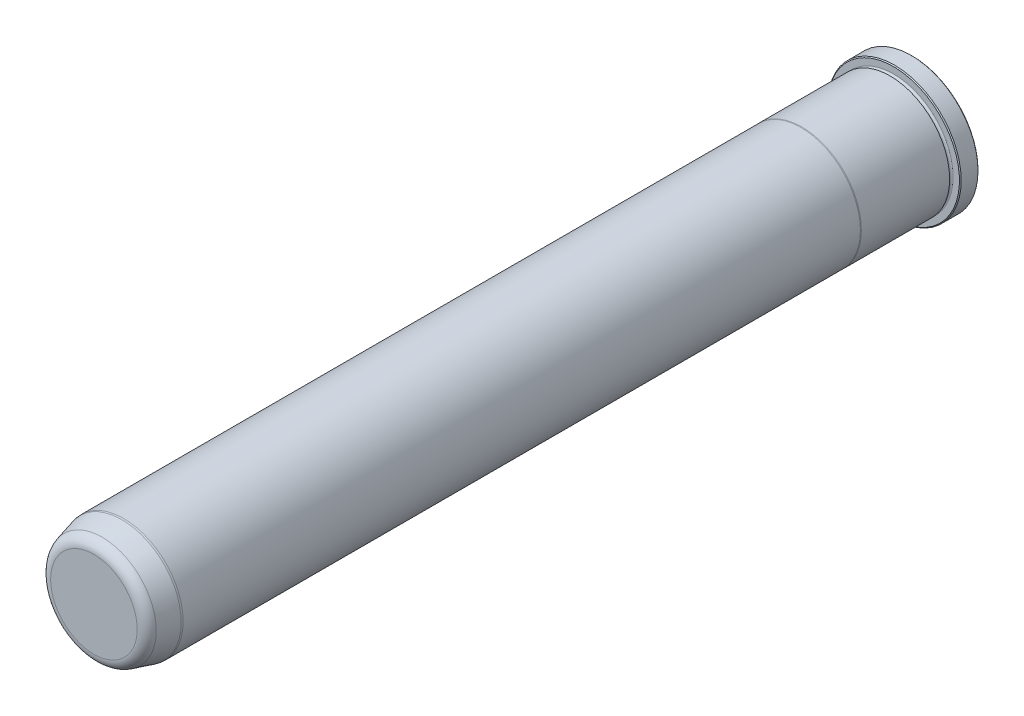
from build123d import *

# Parameters (mm, degrees)
FILLET6_R     = 4.7625
CHAMFER1_SIZE = 0.381


with BuildPart() as part:
    # Sketch1 → Revolve1 (revolve)
    with BuildSketch(Plane(origin=(0, 0, 0), x_dir=(0, 0, -1), z_dir=(1, 0, 0)), mode=Mode.PRIVATE) as revolve1_sk:
        with BuildLine():
            Line((0, 0), (0, 28.448))
            Line((0, 28.448), (-7.9248, 28.448))
            Line((-7.9248, 28.448), (-7.9248, 25.3873))
            ThreePointArc((-7.9248, 25.3873), (-8.6868, 24.6253), (-9.4488, 25.3873))
            Line((-9.4488, 25.3873), (-9.4488, 25.4127))
            Line((-9.4488, 25.4127), (-47.134763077, 25.4127))
            Line((-47.134763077, 25.4127), (-47.498, 25.3873))
            Line((-47.498, 25.3873), (-336.55, 25.3873))
            Line((-336.55, 25.3873), (-337.312, 25.320633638))
            Line((-337.312, 25.320633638), (-349.25, 22.121856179))
            Line((-349.25, 22.121856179), (-349.25, 0))
            Line((-349.25, 0), (0, 0))
        make_face()
    revolve(revolve1_sk.sketch.rotate(Axis((0, 0, 0), (0, 0, -1)), 90), axis=Axis((0, 0, 0), (0, 0, -1)))

    # Fillet6
    fillet6_edges = [part.edges().sort_by_distance(p)[0] for p in [
        (-22.121856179, 0, 349.25),
    ]]
    fillet(fillet6_edges, radius=FILLET6_R)

    # Chamfer1
    chamfer1_edges = [part.edges().sort_by_distance(p)[0] for p in [
        (-28.448, 0, 7.9248),
        (-28.448, 0, 0),
    ]]
    chamfer(chamfer1_edges, length=CHAMFER1_SIZE)


solid = part.part
